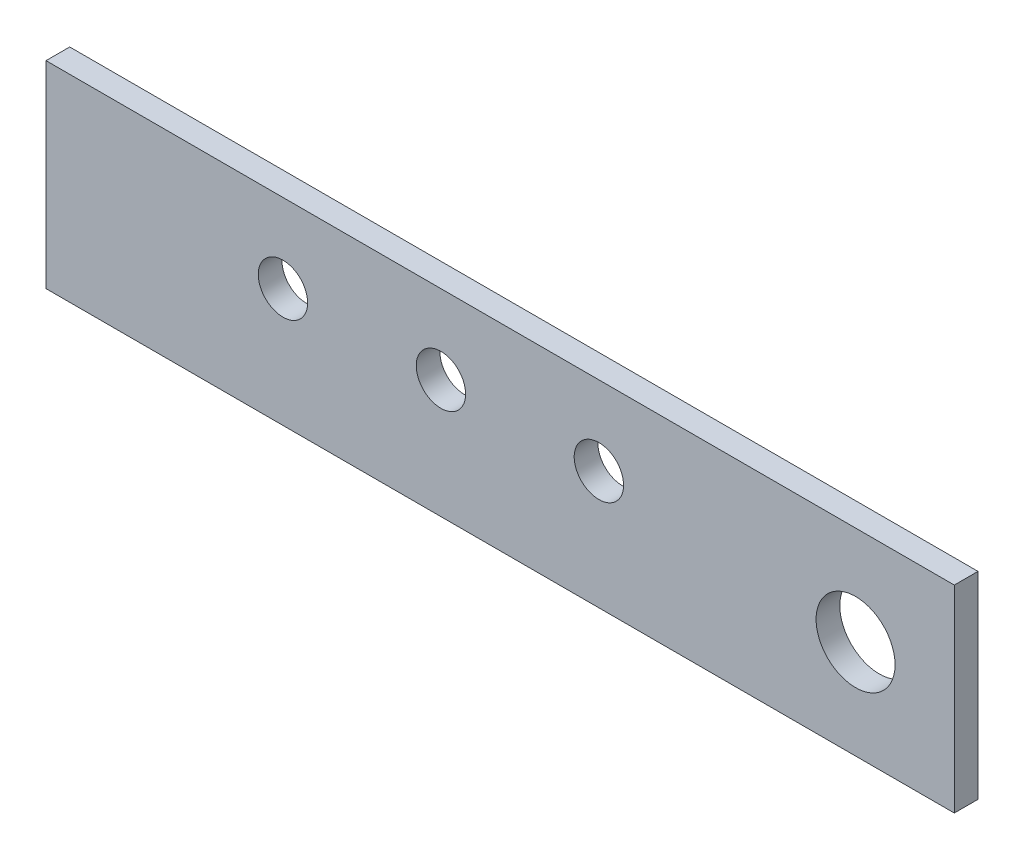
from build123d import *

# Parameters (mm, degrees)
ESQUISSE1_W      = 460
ESQUISSE1_H      = 100
ESQUISSE1_R      = 20
ESQUISSE1_R_2    = 12.5
EXTRUSION1_DEPTH = 12


with BuildPart() as part:
    # Esquisse1 → Extrusion1 (new body)
    with BuildSketch(Plane.XY):
        with Locations((230, -50)):
            Rectangle(ESQUISSE1_W, ESQUISSE1_H)
        with Locations((410, -50)):
            Circle(ESQUISSE1_R, mode=Mode.SUBTRACT)
        with Locations((120, -40)):
            Circle(ESQUISSE1_R_2, mode=Mode.SUBTRACT)
        with Locations((200, -40)):
            Circle(ESQUISSE1_R_2, mode=Mode.SUBTRACT)
        with Locations((280, -40)):
            Circle(ESQUISSE1_R_2, mode=Mode.SUBTRACT)
    extrude(amount=EXTRUSION1_DEPTH)


solid = part.part
